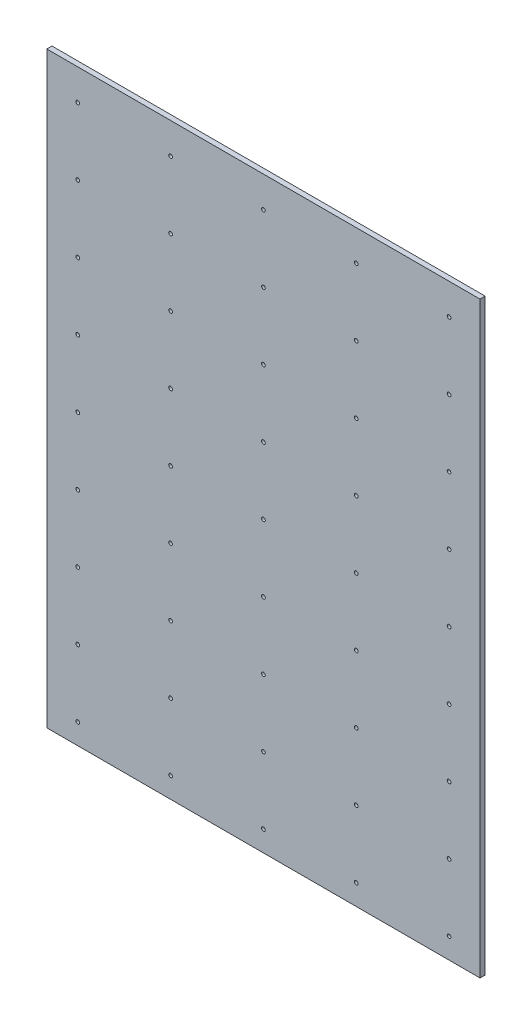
from build123d import *

# Parameters (mm, degrees)
SCHIZZO1_W                   = 840
SCHIZZO1_H                   = 1140
SCHIZZO1_R                   = 3.6
ESTRUSIONE_ESTRUSIONE1_DEPTH = 10


with BuildPart() as part:
    # Schizzo1 → Estrusione-Estrusione1 (new body)
    with BuildSketch(Plane.XY):
        Rectangle(SCHIZZO1_W, SCHIZZO1_H)
        with Locations((-360, 510)):
            Circle(SCHIZZO1_R, mode=Mode.SUBTRACT)
        with Locations((-360, 380)):
            Circle(SCHIZZO1_R, mode=Mode.SUBTRACT)
        with Locations((-360, 250)):
            Circle(SCHIZZO1_R, mode=Mode.SUBTRACT)
        with Locations((-360, 120)):
            Circle(SCHIZZO1_R, mode=Mode.SUBTRACT)
        with Locations((-360, -10)):
            Circle(SCHIZZO1_R, mode=Mode.SUBTRACT)
        with Locations((-360, -140)):
            Circle(SCHIZZO1_R, mode=Mode.SUBTRACT)
        with Locations((-360, -270)):
            Circle(SCHIZZO1_R, mode=Mode.SUBTRACT)
        with Locations((-360, -400)):
            Circle(SCHIZZO1_R, mode=Mode.SUBTRACT)
        with Locations((-360, -530)):
            Circle(SCHIZZO1_R, mode=Mode.SUBTRACT)
        with Locations((-180, 380)):
            Circle(SCHIZZO1_R, mode=Mode.SUBTRACT)
        with Locations((-180, 250)):
            Circle(SCHIZZO1_R, mode=Mode.SUBTRACT)
        with Locations((-180, 120)):
            Circle(SCHIZZO1_R, mode=Mode.SUBTRACT)
        with Locations((-180, -10)):
            Circle(SCHIZZO1_R, mode=Mode.SUBTRACT)
        with Locations((-180, -140)):
            Circle(SCHIZZO1_R, mode=Mode.SUBTRACT)
        with Locations((-180, -270)):
            Circle(SCHIZZO1_R, mode=Mode.SUBTRACT)
        with Locations((-180, -400)):
            Circle(SCHIZZO1_R, mode=Mode.SUBTRACT)
        with Locations((-180, -530)):
            Circle(SCHIZZO1_R, mode=Mode.SUBTRACT)
        with Locations((0, 380)):
            Circle(SCHIZZO1_R, mode=Mode.SUBTRACT)
        with Locations((0, 250)):
            Circle(SCHIZZO1_R, mode=Mode.SUBTRACT)
        with Locations((0, 120)):
            Circle(SCHIZZO1_R, mode=Mode.SUBTRACT)
        with Locations((0, -10)):
            Circle(SCHIZZO1_R, mode=Mode.SUBTRACT)
        with Locations((0, -140)):
            Circle(SCHIZZO1_R, mode=Mode.SUBTRACT)
        with Locations((0, -270)):
            Circle(SCHIZZO1_R, mode=Mode.SUBTRACT)
        with Locations((0, -400)):
            Circle(SCHIZZO1_R, mode=Mode.SUBTRACT)
        with Locations((0, -530)):
            Circle(SCHIZZO1_R, mode=Mode.SUBTRACT)
        with Locations((180, 380)):
            Circle(SCHIZZO1_R, mode=Mode.SUBTRACT)
        with Locations((180, 250)):
            Circle(SCHIZZO1_R, mode=Mode.SUBTRACT)
        with Locations((180, 120)):
            Circle(SCHIZZO1_R, mode=Mode.SUBTRACT)
        with Locations((180, -10)):
            Circle(SCHIZZO1_R, mode=Mode.SUBTRACT)
        with Locations((180, -140)):
            Circle(SCHIZZO1_R, mode=Mode.SUBTRACT)
        with Locations((180, -270)):
            Circle(SCHIZZO1_R, mode=Mode.SUBTRACT)
        with Locations((180, -400)):
            Circle(SCHIZZO1_R, mode=Mode.SUBTRACT)
        with Locations((180, -530)):
            Circle(SCHIZZO1_R, mode=Mode.SUBTRACT)
        with Locations((360, 380)):
            Circle(SCHIZZO1_R, mode=Mode.SUBTRACT)
        with Locations((360, 250)):
            Circle(SCHIZZO1_R, mode=Mode.SUBTRACT)
        with Locations((360, 120)):
            Circle(SCHIZZO1_R, mode=Mode.SUBTRACT)
        with Locations((360, -10)):
            Circle(SCHIZZO1_R, mode=Mode.SUBTRACT)
        with Locations((360, -140)):
            Circle(SCHIZZO1_R, mode=Mode.SUBTRACT)
        with Locations((360, -270)):
            Circle(SCHIZZO1_R, mode=Mode.SUBTRACT)
        with Locations((360, -400)):
            Circle(SCHIZZO1_R, mode=Mode.SUBTRACT)
        with Locations((360, -530)):
            Circle(SCHIZZO1_R, mode=Mode.SUBTRACT)
        with Locations((-180, 510)):
            Circle(SCHIZZO1_R, mode=Mode.SUBTRACT)
        with Locations((0, 510)):
            Circle(SCHIZZO1_R, mode=Mode.SUBTRACT)
        with Locations((180, 510)):
            Circle(SCHIZZO1_R, mode=Mode.SUBTRACT)
        with Locations((360, 510)):
            Circle(SCHIZZO1_R, mode=Mode.SUBTRACT)
    extrude(amount=ESTRUSIONE_ESTRUSIONE1_DEPTH)


solid = part.part
